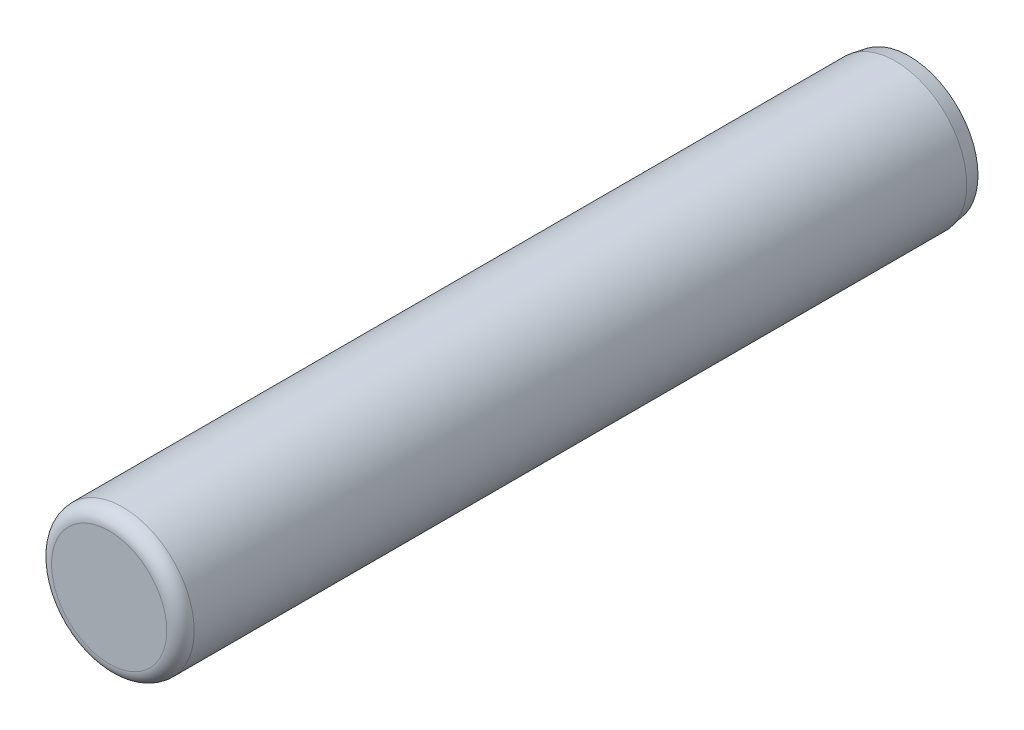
ISO-10303-21;
HEADER;
FILE_DESCRIPTION(('STEP AP214'),'2;1');
FILE_NAME('part.step','',(''),(''),'','','');
FILE_SCHEMA(('AUTOMOTIVE_DESIGN { 1 0 10303 214 1 1 1 1 }'));
ENDSEC;
DATA;
#1=APPLICATION_CONTEXT('core data for automotive mechanical design processes');
#2=APPLICATION_PROTOCOL_DEFINITION('international standard','automotive_design',2000,#1);
#3=PRODUCT_CONTEXT('',#1,'mechanical');
#4=PRODUCT('Part','Part','',(#3));
#5=PRODUCT_RELATED_PRODUCT_CATEGORY('part','',(#4));
#6=PRODUCT_DEFINITION_FORMATION('','',#4);
#7=PRODUCT_DEFINITION_CONTEXT('part definition',#1,'design');
#8=PRODUCT_DEFINITION('design','',#6,#7);
#9=PRODUCT_DEFINITION_SHAPE('','',#8);
#10=(LENGTH_UNIT() NAMED_UNIT(*) SI_UNIT(.MILLI.,.METRE.));
#11=(NAMED_UNIT(*) PLANE_ANGLE_UNIT() SI_UNIT($,.RADIAN.));
#12=(NAMED_UNIT(*) SI_UNIT($,.STERADIAN.) SOLID_ANGLE_UNIT());
#13=UNCERTAINTY_MEASURE_WITH_UNIT(LENGTH_MEASURE(1.E-05),#10,'distance_accuracy_value','');
#14=(GEOMETRIC_REPRESENTATION_CONTEXT(3) GLOBAL_UNCERTAINTY_ASSIGNED_CONTEXT((#13)) GLOBAL_UNIT_ASSIGNED_CONTEXT((#10,
#11,#12)) REPRESENTATION_CONTEXT('',''));
#15=CARTESIAN_POINT('',(0.,0.,0.));
#16=DIRECTION('',(0.,0.,1.));
#17=DIRECTION('',(1.,0.,0.));
#18=AXIS2_PLACEMENT_3D('',#15,#16,#17);
#19=CARTESIAN_POINT('',(0.,0.,22.225));
#20=DIRECTION('',(0.,0.,-1.));
#21=DIRECTION('',(-1.,0.,0.));
#22=AXIS2_PLACEMENT_3D('',#19,#20,#21);
#23=CYLINDRICAL_SURFACE('',#22,1.9812);
#24=CARTESIAN_POINT('',(0.,0.,0.380999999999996));
#25=DIRECTION('',(0.,0.,1.));
#26=DIRECTION('',(1.,0.,0.));
#27=AXIS2_PLACEMENT_3D('',#24,#25,#26);
#28=CIRCLE('',#27,1.9812);
#29=CARTESIAN_POINT('',(1.9812,0.,0.380999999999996));
#30=VERTEX_POINT('',#29);
#31=EDGE_CURVE('E37',#30,#30,#28,.T.);
#32=ORIENTED_EDGE('',*,*,#31,.T.);
#33=EDGE_LOOP('',(#32));
#34=FACE_BOUND('',#33,.T.);
#35=CARTESIAN_POINT('',(0.,0.,21.844));
#36=DIRECTION('',(0.,0.,1.));
#37=DIRECTION('',(1.,0.,0.));
#38=AXIS2_PLACEMENT_3D('',#35,#36,#37);
#39=CIRCLE('',#38,1.9812);
#40=CARTESIAN_POINT('',(1.9812,0.,21.844));
#41=VERTEX_POINT('',#40);
#42=EDGE_CURVE('E41',#41,#41,#39,.F.);
#43=ORIENTED_EDGE('',*,*,#42,.T.);
#44=EDGE_LOOP('',(#43));
#45=FACE_BOUND('',#44,.T.);
#46=ADVANCED_FACE('F30',(#34,#45),#23,.T.);
#47=CARTESIAN_POINT('',(0.,0.,22.225));
#48=DIRECTION('',(0.,0.,1.));
#49=DIRECTION('',(1.,0.,0.));
#50=AXIS2_PLACEMENT_3D('',#47,#48,#49);
#51=PLANE('',#50);
#52=CARTESIAN_POINT('',(0.,0.,22.225));
#53=DIRECTION('',(0.,0.,1.));
#54=DIRECTION('',(1.,0.,0.));
#55=AXIS2_PLACEMENT_3D('',#52,#53,#54);
#56=CIRCLE('',#55,1.6002);
#57=CARTESIAN_POINT('',(1.6002,0.,22.225));
#58=VERTEX_POINT('',#57);
#59=EDGE_CURVE('E45',#58,#58,#56,.T.);
#60=ORIENTED_EDGE('',*,*,#59,.T.);
#61=EDGE_LOOP('',(#60));
#62=FACE_BOUND('',#61,.T.);
#63=ADVANCED_FACE('F51',(#62),#51,.T.);
#64=CARTESIAN_POINT('',(0.,0.,0.));
#65=DIRECTION('',(0.,0.,1.));
#66=DIRECTION('',(1.,0.,0.));
#67=AXIS2_PLACEMENT_3D('',#64,#65,#66);
#68=PLANE('',#67);
#69=CARTESIAN_POINT('',(0.,0.,0.));
#70=DIRECTION('',(0.,0.,1.));
#71=DIRECTION('',(1.,0.,0.));
#72=AXIS2_PLACEMENT_3D('',#69,#70,#71);
#73=CIRCLE('',#72,1.91401942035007);
#74=CARTESIAN_POINT('',(1.91401942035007,0.,0.));
#75=VERTEX_POINT('',#74);
#76=EDGE_CURVE('E10',#75,#75,#73,.F.);
#77=ORIENTED_EDGE('',*,*,#76,.T.);
#78=EDGE_LOOP('',(#77));
#79=FACE_BOUND('',#78,.T.);
#80=ADVANCED_FACE('F55',(#79),#68,.F.);
#81=CARTESIAN_POINT('',(0.,0.,21.844));
#82=DIRECTION('',(0.,0.,1.));
#83=DIRECTION('',(1.,0.,0.));
#84=AXIS2_PLACEMENT_3D('',#81,#82,#83);
#85=TOROIDAL_SURFACE('',#84,1.6002,0.381);
#86=ORIENTED_EDGE('',*,*,#42,.F.);
#87=EDGE_LOOP('',(#86));
#88=FACE_BOUND('',#87,.T.);
#89=ORIENTED_EDGE('',*,*,#59,.F.);
#90=EDGE_LOOP('',(#89));
#91=FACE_BOUND('',#90,.T.);
#92=ADVANCED_FACE('F53',(#88,#91),#85,.T.);
#93=CARTESIAN_POINT('',(0.,0.,0.380999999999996));
#94=DIRECTION('',(0.,0.,1.));
#95=DIRECTION('',(1.,0.,0.));
#96=AXIS2_PLACEMENT_3D('',#93,#94,#95);
#97=CONICAL_SURFACE('',#96,1.9812,0.174532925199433);
#98=ORIENTED_EDGE('',*,*,#76,.F.);
#99=EDGE_LOOP('',(#98));
#100=FACE_BOUND('',#99,.T.);
#101=ORIENTED_EDGE('',*,*,#31,.F.);
#102=EDGE_LOOP('',(#101));
#103=FACE_BOUND('',#102,.T.);
#104=ADVANCED_FACE('F32',(#100,#103),#97,.T.);
#105=CLOSED_SHELL('',(#46,#63,#80,#92,#104));
#106=MANIFOLD_SOLID_BREP('B2',#105);
#107=ADVANCED_BREP_SHAPE_REPRESENTATION('',(#18,#106),#14);
#108=SHAPE_DEFINITION_REPRESENTATION(#9,#107);
ENDSEC;
END-ISO-10303-21;
